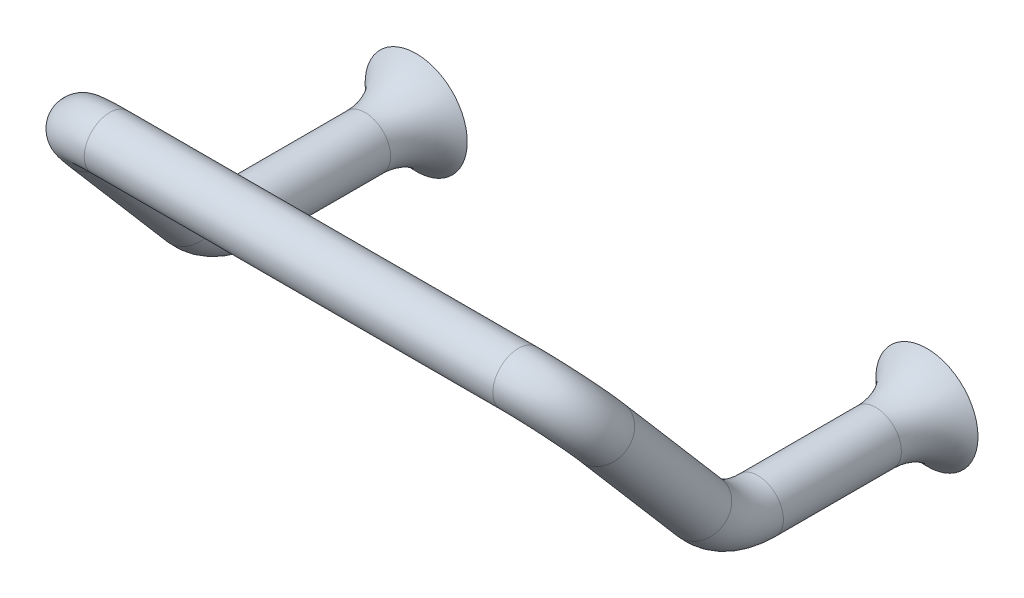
ISO-10303-21;
HEADER;
FILE_DESCRIPTION(('STEP AP214'),'2;1');
FILE_NAME('part.step','',(''),(''),'','','');
FILE_SCHEMA(('AUTOMOTIVE_DESIGN { 1 0 10303 214 1 1 1 1 }'));
ENDSEC;
DATA;
#1=APPLICATION_CONTEXT('core data for automotive mechanical design processes');
#2=APPLICATION_PROTOCOL_DEFINITION('international standard','automotive_design',2000,#1);
#3=PRODUCT_CONTEXT('',#1,'mechanical');
#4=PRODUCT('Part','Part','',(#3));
#5=PRODUCT_RELATED_PRODUCT_CATEGORY('part','',(#4));
#6=PRODUCT_DEFINITION_FORMATION('','',#4);
#7=PRODUCT_DEFINITION_CONTEXT('part definition',#1,'design');
#8=PRODUCT_DEFINITION('design','',#6,#7);
#9=PRODUCT_DEFINITION_SHAPE('','',#8);
#10=(LENGTH_UNIT() NAMED_UNIT(*) SI_UNIT(.MILLI.,.METRE.));
#11=(NAMED_UNIT(*) PLANE_ANGLE_UNIT() SI_UNIT($,.RADIAN.));
#12=(NAMED_UNIT(*) SI_UNIT($,.STERADIAN.) SOLID_ANGLE_UNIT());
#13=UNCERTAINTY_MEASURE_WITH_UNIT(LENGTH_MEASURE(1.E-05),#10,'distance_accuracy_value','');
#14=(GEOMETRIC_REPRESENTATION_CONTEXT(3) GLOBAL_UNCERTAINTY_ASSIGNED_CONTEXT((#13)) GLOBAL_UNIT_ASSIGNED_CONTEXT((#10,
#11,#12)) REPRESENTATION_CONTEXT('',''));
#15=CARTESIAN_POINT('',(0.,0.,0.));
#16=DIRECTION('',(0.,0.,1.));
#17=DIRECTION('',(1.,0.,0.));
#18=AXIS2_PLACEMENT_3D('',#15,#16,#17);
#19=CARTESIAN_POINT('',(100.,0.,33.1009761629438));
#20=DIRECTION('',(0.,0.,-1.));
#21=DIRECTION('',(0.,1.,0.));
#22=AXIS2_PLACEMENT_3D('',#19,#20,#21);
#23=CYLINDRICAL_SURFACE('',#22,5.);
#24=CARTESIAN_POINT('',(100.,0.,33.1009761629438));
#25=DIRECTION('',(0.,0.,-1.));
#26=DIRECTION('',(0.,-1.,0.));
#27=AXIS2_PLACEMENT_3D('',#24,#25,#26);
#28=CIRCLE('',#27,5.);
#29=CARTESIAN_POINT('',(100.,-5.,33.1009761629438));
#30=VERTEX_POINT('',#29);
#31=EDGE_CURVE('E32',#30,#30,#28,.T.);
#32=ORIENTED_EDGE('',*,*,#31,.T.);
#33=EDGE_LOOP('',(#32));
#34=FACE_BOUND('',#33,.T.);
#35=CARTESIAN_POINT('',(100.,0.,10.));
#36=DIRECTION('',(0.,0.,-1.));
#37=DIRECTION('',(1.,0.,0.));
#38=AXIS2_PLACEMENT_3D('',#35,#36,#37);
#39=CIRCLE('',#38,5.);
#40=CARTESIAN_POINT('',(105.,0.,9.99999999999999));
#41=VERTEX_POINT('',#40);
#42=EDGE_CURVE('E62',#41,#41,#39,.T.);
#43=ORIENTED_EDGE('',*,*,#42,.F.);
#44=EDGE_LOOP('',(#43));
#45=FACE_BOUND('',#44,.T.);
#46=ADVANCED_FACE('F12',(#34,#45),#23,.T.);
#47=CARTESIAN_POINT('',(100.,15.,33.1009761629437));
#48=DIRECTION('',(1.,0.,0.));
#49=DIRECTION('',(0.,1.,0.));
#50=AXIS2_PLACEMENT_3D('',#47,#48,#49);
#51=TOROIDAL_SURFACE('',#50,15.,5.);
#52=CARTESIAN_POINT('',(100.,5.23812939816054,44.4898251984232));
#53=DIRECTION('',(0.,-0.759256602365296,-0.650791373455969));
#54=DIRECTION('',(0.,-0.65079137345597,0.759256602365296));
#55=AXIS2_PLACEMENT_3D('',#52,#53,#54);
#56=CIRCLE('',#55,5.);
#57=CARTESIAN_POINT('',(100.,1.98417253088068,48.2861082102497));
#58=VERTEX_POINT('',#57);
#59=EDGE_CURVE('E35',#58,#58,#56,.T.);
#60=CARTESIAN_POINT('',(100.,15.,33.1009761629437));
#61=DIRECTION('',(1.,0.,0.));
#62=DIRECTION('',(0.,1.,0.));
#63=AXIS2_PLACEMENT_3D('',#60,#61,#62);
#64=CIRCLE('',#63,20.);
#65=EDGE_CURVE('',#58,#30,#64,.T.);
#66=ORIENTED_EDGE('',*,*,#59,.T.);
#67=ORIENTED_EDGE('',*,*,#31,.F.);
#68=ORIENTED_EDGE('',*,*,#65,.T.);
#69=ORIENTED_EDGE('',*,*,#65,.F.);
#70=EDGE_LOOP('',(#66,#68,#67,#69));
#71=FACE_BOUND('',#70,.T.);
#72=ADVANCED_FACE('F94',(#71),#51,.T.);
#73=CARTESIAN_POINT('',(100.,27.4074339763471,63.4920862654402));
#74=DIRECTION('',(0.,-0.759256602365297,-0.650791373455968));
#75=DIRECTION('',(0.,0.650791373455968,-0.759256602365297));
#76=AXIS2_PLACEMENT_3D('',#73,#74,#75);
#77=CYLINDRICAL_SURFACE('',#76,5.);
#78=CARTESIAN_POINT('',(100.,27.4074339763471,63.4920862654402));
#79=DIRECTION('',(0.,-0.759256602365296,-0.650791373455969));
#80=DIRECTION('',(0.,-0.65079137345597,0.759256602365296));
#81=AXIS2_PLACEMENT_3D('',#78,#79,#80);
#82=CIRCLE('',#81,5.);
#83=CARTESIAN_POINT('',(105.,27.4074339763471,63.4920862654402));
#84=VERTEX_POINT('',#83);
#85=EDGE_CURVE('E38',#84,#84,#82,.T.);
#86=ORIENTED_EDGE('',*,*,#85,.T.);
#87=EDGE_LOOP('',(#86));
#88=FACE_BOUND('',#87,.T.);
#89=ORIENTED_EDGE('',*,*,#59,.F.);
#90=EDGE_LOOP('',(#89));
#91=FACE_BOUND('',#90,.T.);
#92=ADVANCED_FACE('F101',(#88,#91),#77,.T.);
#93=CARTESIAN_POINT('',(90.,27.4074339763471,63.4920862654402));
#94=DIRECTION('',(0.,0.650791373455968,-0.759256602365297));
#95=DIRECTION('',(0.,0.759256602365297,0.650791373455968));
#96=AXIS2_PLACEMENT_3D('',#93,#94,#95);
#97=TOROIDAL_SURFACE('',#96,10.,5.);
#98=CARTESIAN_POINT('',(90.,35.,70.));
#99=DIRECTION('',(1.,0.,0.));
#100=DIRECTION('',(0.,-0.650791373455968,0.759256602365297));
#101=AXIS2_PLACEMENT_3D('',#98,#99,#100);
#102=CIRCLE('',#101,5.);
#103=CARTESIAN_POINT('',(90.,38.7962830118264,73.2539568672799));
#104=VERTEX_POINT('',#103);
#105=EDGE_CURVE('E41',#104,#104,#102,.T.);
#106=CARTESIAN_POINT('',(90.,27.4074339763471,63.4920862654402));
#107=DIRECTION('',(0.,0.650791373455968,-0.759256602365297));
#108=DIRECTION('',(0.,0.759256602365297,0.650791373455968));
#109=AXIS2_PLACEMENT_3D('',#106,#107,#108);
#110=CIRCLE('',#109,15.);
#111=EDGE_CURVE('',#104,#84,#110,.T.);
#112=ORIENTED_EDGE('',*,*,#105,.T.);
#113=ORIENTED_EDGE('',*,*,#85,.F.);
#114=ORIENTED_EDGE('',*,*,#111,.T.);
#115=ORIENTED_EDGE('',*,*,#111,.F.);
#116=EDGE_LOOP('',(#112,#114,#113,#115));
#117=FACE_BOUND('',#116,.T.);
#118=ADVANCED_FACE('F158',(#117),#97,.T.);
#119=CARTESIAN_POINT('',(10.,35.,70.));
#120=DIRECTION('',(1.,0.,0.));
#121=DIRECTION('',(0.,0.,1.));
#122=AXIS2_PLACEMENT_3D('',#119,#120,#121);
#123=CYLINDRICAL_SURFACE('',#122,5.);
#124=CARTESIAN_POINT('',(10.,35.,70.));
#125=DIRECTION('',(1.,0.,0.));
#126=DIRECTION('',(0.,-0.650791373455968,0.759256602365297));
#127=AXIS2_PLACEMENT_3D('',#124,#125,#126);
#128=CIRCLE('',#127,5.);
#129=CARTESIAN_POINT('',(10.,38.7962830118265,73.2539568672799));
#130=VERTEX_POINT('',#129);
#131=EDGE_CURVE('E44',#130,#130,#128,.T.);
#132=ORIENTED_EDGE('',*,*,#131,.T.);
#133=EDGE_LOOP('',(#132));
#134=FACE_BOUND('',#133,.T.);
#135=ORIENTED_EDGE('',*,*,#105,.F.);
#136=EDGE_LOOP('',(#135));
#137=FACE_BOUND('',#136,.T.);
#138=ADVANCED_FACE('F154',(#134,#137),#123,.T.);
#139=CARTESIAN_POINT('',(10.,27.4074339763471,63.4920862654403));
#140=DIRECTION('',(0.,0.650791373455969,-0.759256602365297));
#141=DIRECTION('',(0.,0.759256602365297,0.650791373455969));
#142=AXIS2_PLACEMENT_3D('',#139,#140,#141);
#143=TOROIDAL_SURFACE('',#142,10.,5.);
#144=CARTESIAN_POINT('',(0.,27.4074339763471,63.4920862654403));
#145=DIRECTION('',(0.,0.759256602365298,0.650791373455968));
#146=DIRECTION('',(0.,-0.650791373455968,0.759256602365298));
#147=AXIS2_PLACEMENT_3D('',#144,#145,#146);
#148=CIRCLE('',#147,5.);
#149=CARTESIAN_POINT('',(-5.,27.4074339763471,63.4920862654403));
#150=VERTEX_POINT('',#149);
#151=EDGE_CURVE('E47',#150,#150,#148,.T.);
#152=CARTESIAN_POINT('',(10.,27.4074339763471,63.4920862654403));
#153=DIRECTION('',(0.,0.650791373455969,-0.759256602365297));
#154=DIRECTION('',(0.,0.759256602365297,0.650791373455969));
#155=AXIS2_PLACEMENT_3D('',#152,#153,#154);
#156=CIRCLE('',#155,15.);
#157=EDGE_CURVE('',#150,#130,#156,.T.);
#158=ORIENTED_EDGE('',*,*,#151,.T.);
#159=ORIENTED_EDGE('',*,*,#131,.F.);
#160=ORIENTED_EDGE('',*,*,#157,.T.);
#161=ORIENTED_EDGE('',*,*,#157,.F.);
#162=EDGE_LOOP('',(#158,#160,#159,#161));
#163=FACE_BOUND('',#162,.T.);
#164=ADVANCED_FACE('F150',(#163),#143,.T.);
#165=CARTESIAN_POINT('',(0.,5.23812939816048,44.4898251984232));
#166=DIRECTION('',(0.,0.759256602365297,0.650791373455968));
#167=DIRECTION('',(0.,-0.650791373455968,0.759256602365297));
#168=AXIS2_PLACEMENT_3D('',#165,#166,#167);
#169=CYLINDRICAL_SURFACE('',#168,5.);
#170=CARTESIAN_POINT('',(0.,5.23812939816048,44.4898251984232));
#171=DIRECTION('',(0.,0.759256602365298,0.650791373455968));
#172=DIRECTION('',(0.,-0.650791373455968,0.759256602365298));
#173=AXIS2_PLACEMENT_3D('',#170,#171,#172);
#174=CIRCLE('',#173,5.);
#175=CARTESIAN_POINT('',(0.,1.98417253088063,48.2861082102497));
#176=VERTEX_POINT('',#175);
#177=EDGE_CURVE('E50',#176,#176,#174,.T.);
#178=ORIENTED_EDGE('',*,*,#177,.T.);
#179=EDGE_LOOP('',(#178));
#180=FACE_BOUND('',#179,.T.);
#181=ORIENTED_EDGE('',*,*,#151,.F.);
#182=EDGE_LOOP('',(#181));
#183=FACE_BOUND('',#182,.T.);
#184=ADVANCED_FACE('F146',(#180,#183),#169,.T.);
#185=CARTESIAN_POINT('',(0.,15.,33.1009761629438));
#186=DIRECTION('',(-1.,0.,0.));
#187=DIRECTION('',(0.,-1.,0.));
#188=AXIS2_PLACEMENT_3D('',#185,#186,#187);
#189=TOROIDAL_SURFACE('',#188,15.,5.);
#190=CARTESIAN_POINT('',(0.,0.,33.1009761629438));
#191=DIRECTION('',(0.,0.,1.));
#192=DIRECTION('',(0.,-1.,0.));
#193=AXIS2_PLACEMENT_3D('',#190,#191,#192);
#194=CIRCLE('',#193,5.);
#195=CARTESIAN_POINT('',(0.,-5.,33.1009761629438));
#196=VERTEX_POINT('',#195);
#197=EDGE_CURVE('E53',#196,#196,#194,.T.);
#198=CARTESIAN_POINT('',(0.,15.,33.1009761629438));
#199=DIRECTION('',(-1.,0.,0.));
#200=DIRECTION('',(0.,-1.,0.));
#201=AXIS2_PLACEMENT_3D('',#198,#199,#200);
#202=CIRCLE('',#201,20.);
#203=EDGE_CURVE('',#196,#176,#202,.T.);
#204=ORIENTED_EDGE('',*,*,#197,.T.);
#205=ORIENTED_EDGE('',*,*,#177,.F.);
#206=ORIENTED_EDGE('',*,*,#203,.T.);
#207=ORIENTED_EDGE('',*,*,#203,.F.);
#208=EDGE_LOOP('',(#204,#206,#205,#207));
#209=FACE_BOUND('',#208,.T.);
#210=ADVANCED_FACE('F142',(#209),#189,.T.);
#211=CARTESIAN_POINT('',(0.,0.,33.1009761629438));
#212=DIRECTION('',(0.,0.,-1.));
#213=DIRECTION('',(0.,1.,0.));
#214=AXIS2_PLACEMENT_3D('',#211,#212,#213);
#215=CYLINDRICAL_SURFACE('',#214,5.);
#216=CARTESIAN_POINT('',(0.,0.,10.));
#217=DIRECTION('',(0.,0.,-1.));
#218=DIRECTION('',(0.,1.,0.));
#219=AXIS2_PLACEMENT_3D('',#216,#217,#218);
#220=CIRCLE('',#219,5.);
#221=CARTESIAN_POINT('',(0.,5.,10.));
#222=VERTEX_POINT('',#221);
#223=EDGE_CURVE('E59',#222,#222,#220,.T.);
#224=ORIENTED_EDGE('',*,*,#223,.F.);
#225=EDGE_LOOP('',(#224));
#226=FACE_BOUND('',#225,.T.);
#227=ORIENTED_EDGE('',*,*,#197,.F.);
#228=EDGE_LOOP('',(#227));
#229=FACE_BOUND('',#228,.T.);
#230=ADVANCED_FACE('F137',(#226,#229),#215,.T.);
#231=CARTESIAN_POINT('',(0.,0.,10.));
#232=DIRECTION('',(0.,0.,-1.));
#233=DIRECTION('',(0.,1.,0.));
#234=AXIS2_PLACEMENT_3D('',#231,#232,#233);
#235=TOROIDAL_SURFACE('',#234,17.5,12.5);
#236=ORIENTED_EDGE('',*,*,#223,.T.);
#237=EDGE_LOOP('',(#236));
#238=FACE_BOUND('',#237,.T.);
#239=CARTESIAN_POINT('',(0.,0.,0.));
#240=DIRECTION('',(0.,0.,-1.));
#241=DIRECTION('',(0.,1.,0.));
#242=AXIS2_PLACEMENT_3D('',#239,#240,#241);
#243=CIRCLE('',#242,10.);
#244=CARTESIAN_POINT('',(0.,9.99999999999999,0.));
#245=VERTEX_POINT('',#244);
#246=EDGE_CURVE('E56',#245,#245,#243,.T.);
#247=ORIENTED_EDGE('',*,*,#246,.F.);
#248=EDGE_LOOP('',(#247));
#249=FACE_BOUND('',#248,.T.);
#250=ADVANCED_FACE('F132',(#238,#249),#235,.F.);
#251=CARTESIAN_POINT('',(0.,0.,0.));
#252=DIRECTION('',(0.,0.,1.));
#253=DIRECTION('',(0.,-1.,0.));
#254=AXIS2_PLACEMENT_3D('',#251,#252,#253);
#255=PLANE('',#254);
#256=CARTESIAN_POINT('',(0.,0.,0.));
#257=DIRECTION('',(0.,0.,1.));
#258=DIRECTION('',(1.,0.,0.));
#259=AXIS2_PLACEMENT_3D('',#256,#257,#258);
#260=CIRCLE('',#259,2.95);
#261=CARTESIAN_POINT('',(2.95,0.,0.));
#262=VERTEX_POINT('',#261);
#263=EDGE_CURVE('E8',#262,#262,#260,.T.);
#264=ORIENTED_EDGE('',*,*,#263,.T.);
#265=EDGE_LOOP('',(#264));
#266=FACE_BOUND('',#265,.T.);
#267=ORIENTED_EDGE('',*,*,#246,.T.);
#268=EDGE_LOOP('',(#267));
#269=FACE_BOUND('',#268,.T.);
#270=ADVANCED_FACE('F125',(#266,#269),#255,.F.);
#271=CARTESIAN_POINT('',(100.,0.,10.));
#272=DIRECTION('',(0.,0.,-1.));
#273=DIRECTION('',(1.,0.,0.));
#274=AXIS2_PLACEMENT_3D('',#271,#272,#273);
#275=TOROIDAL_SURFACE('',#274,17.5,12.5);
#276=ORIENTED_EDGE('',*,*,#42,.T.);
#277=EDGE_LOOP('',(#276));
#278=FACE_BOUND('',#277,.T.);
#279=CARTESIAN_POINT('',(100.,0.,0.));
#280=DIRECTION('',(0.,0.,-1.));
#281=DIRECTION('',(1.,0.,0.));
#282=AXIS2_PLACEMENT_3D('',#279,#280,#281);
#283=CIRCLE('',#282,10.);
#284=CARTESIAN_POINT('',(110.,0.,0.));
#285=VERTEX_POINT('',#284);
#286=EDGE_CURVE('E65',#285,#285,#283,.T.);
#287=ORIENTED_EDGE('',*,*,#286,.F.);
#288=EDGE_LOOP('',(#287));
#289=FACE_BOUND('',#288,.T.);
#290=ADVANCED_FACE('F120',(#278,#289),#275,.F.);
#291=CARTESIAN_POINT('',(100.,0.,0.));
#292=DIRECTION('',(0.,0.,-1.));
#293=DIRECTION('',(0.,-1.,0.));
#294=AXIS2_PLACEMENT_3D('',#291,#292,#293);
#295=PLANE('',#294);
#296=CARTESIAN_POINT('',(100.,0.,0.));
#297=DIRECTION('',(0.,0.,-1.));
#298=DIRECTION('',(-1.,0.,0.));
#299=AXIS2_PLACEMENT_3D('',#296,#297,#298);
#300=CIRCLE('',#299,2.95);
#301=CARTESIAN_POINT('',(97.05,0.,0.));
#302=VERTEX_POINT('',#301);
#303=EDGE_CURVE('E23',#302,#302,#300,.F.);
#304=ORIENTED_EDGE('',*,*,#303,.T.);
#305=EDGE_LOOP('',(#304));
#306=FACE_BOUND('',#305,.T.);
#307=ORIENTED_EDGE('',*,*,#286,.T.);
#308=EDGE_LOOP('',(#307));
#309=FACE_BOUND('',#308,.T.);
#310=ADVANCED_FACE('F117',(#306,#309),#295,.T.);
#311=CARTESIAN_POINT('',(0.,0.,10.));
#312=DIRECTION('',(0.,0.,-1.));
#313=DIRECTION('',(0.,1.,0.));
#314=AXIS2_PLACEMENT_3D('',#311,#312,#313);
#315=CYLINDRICAL_SURFACE('',#314,2.5);
#316=CARTESIAN_POINT('',(0.,0.,0.45));
#317=DIRECTION('',(0.,0.,1.));
#318=DIRECTION('',(1.,0.,0.));
#319=AXIS2_PLACEMENT_3D('',#316,#317,#318);
#320=CIRCLE('',#319,2.5);
#321=CARTESIAN_POINT('',(2.5,0.,0.45));
#322=VERTEX_POINT('',#321);
#323=EDGE_CURVE('E19',#322,#322,#320,.F.);
#324=ORIENTED_EDGE('',*,*,#323,.T.);
#325=EDGE_LOOP('',(#324));
#326=FACE_BOUND('',#325,.T.);
#327=CARTESIAN_POINT('',(0.,0.,10.));
#328=DIRECTION('',(0.,0.,-1.));
#329=DIRECTION('',(0.,1.,0.));
#330=AXIS2_PLACEMENT_3D('',#327,#328,#329);
#331=CIRCLE('',#330,2.5);
#332=CARTESIAN_POINT('',(0.,2.5,10.));
#333=VERTEX_POINT('',#332);
#334=EDGE_CURVE('E68',#333,#333,#331,.T.);
#335=ORIENTED_EDGE('',*,*,#334,.F.);
#336=EDGE_LOOP('',(#335));
#337=FACE_BOUND('',#336,.T.);
#338=ADVANCED_FACE('F90',(#326,#337),#315,.F.);
#339=CARTESIAN_POINT('',(0.,0.,10.));
#340=DIRECTION('',(0.,0.,-1.));
#341=DIRECTION('',(0.,1.,0.));
#342=AXIS2_PLACEMENT_3D('',#339,#340,#341);
#343=PLANE('',#342);
#344=ORIENTED_EDGE('',*,*,#334,.T.);
#345=EDGE_LOOP('',(#344));
#346=FACE_BOUND('',#345,.T.);
#347=ADVANCED_FACE('F79',(#346),#343,.T.);
#348=CARTESIAN_POINT('',(100.,0.,10.));
#349=DIRECTION('',(0.,0.,-1.));
#350=DIRECTION('',(0.,1.,0.));
#351=AXIS2_PLACEMENT_3D('',#348,#349,#350);
#352=CYLINDRICAL_SURFACE('',#351,2.5);
#353=CARTESIAN_POINT('',(100.,0.,0.45));
#354=DIRECTION('',(0.,0.,-1.));
#355=DIRECTION('',(-1.,0.,0.));
#356=AXIS2_PLACEMENT_3D('',#353,#354,#355);
#357=CIRCLE('',#356,2.5);
#358=CARTESIAN_POINT('',(97.5,0.,0.45));
#359=VERTEX_POINT('',#358);
#360=EDGE_CURVE('E27',#359,#359,#357,.T.);
#361=ORIENTED_EDGE('',*,*,#360,.T.);
#362=EDGE_LOOP('',(#361));
#363=FACE_BOUND('',#362,.T.);
#364=CARTESIAN_POINT('',(100.,0.,10.));
#365=DIRECTION('',(0.,0.,-1.));
#366=DIRECTION('',(0.,1.,0.));
#367=AXIS2_PLACEMENT_3D('',#364,#365,#366);
#368=CIRCLE('',#367,2.5);
#369=CARTESIAN_POINT('',(100.,2.50000000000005,10.));
#370=VERTEX_POINT('',#369);
#371=EDGE_CURVE('E71',#370,#370,#368,.T.);
#372=ORIENTED_EDGE('',*,*,#371,.F.);
#373=EDGE_LOOP('',(#372));
#374=FACE_BOUND('',#373,.T.);
#375=ADVANCED_FACE('F77',(#363,#374),#352,.F.);
#376=CARTESIAN_POINT('',(100.,0.,10.));
#377=DIRECTION('',(0.,0.,-1.));
#378=DIRECTION('',(0.,1.,0.));
#379=AXIS2_PLACEMENT_3D('',#376,#377,#378);
#380=PLANE('',#379);
#381=ORIENTED_EDGE('',*,*,#371,.T.);
#382=EDGE_LOOP('',(#381));
#383=FACE_BOUND('',#382,.T.);
#384=ADVANCED_FACE('F75',(#383),#380,.T.);
#385=CARTESIAN_POINT('',(100.,0.,0.45));
#386=DIRECTION('',(0.,0.,-1.));
#387=DIRECTION('',(-1.,0.,0.));
#388=AXIS2_PLACEMENT_3D('',#385,#386,#387);
#389=CONICAL_SURFACE('',#388,2.5,0.785398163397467);
#390=ORIENTED_EDGE('',*,*,#303,.F.);
#391=EDGE_LOOP('',(#390));
#392=FACE_BOUND('',#391,.T.);
#393=ORIENTED_EDGE('',*,*,#360,.F.);
#394=EDGE_LOOP('',(#393));
#395=FACE_BOUND('',#394,.T.);
#396=ADVANCED_FACE('F88',(#392,#395),#389,.F.);
#397=CARTESIAN_POINT('',(0.,0.,0.45));
#398=DIRECTION('',(0.,0.,-1.));
#399=DIRECTION('',(-1.,0.,0.));
#400=AXIS2_PLACEMENT_3D('',#397,#398,#399);
#401=CONICAL_SURFACE('',#400,2.5,0.785398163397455);
#402=ORIENTED_EDGE('',*,*,#263,.F.);
#403=EDGE_LOOP('',(#402));
#404=FACE_BOUND('',#403,.T.);
#405=ORIENTED_EDGE('',*,*,#323,.F.);
#406=EDGE_LOOP('',(#405));
#407=FACE_BOUND('',#406,.T.);
#408=ADVANCED_FACE('F14',(#404,#407),#401,.F.);
#409=CLOSED_SHELL('',(#46,#72,#92,#118,#138,#164,#184,#210,#230,#250,#270,#290,#310,#338,#347,
#375,#384,#396,#408));
#410=MANIFOLD_SOLID_BREP('B1',#409);
#411=ADVANCED_BREP_SHAPE_REPRESENTATION('',(#18,#410),#14);
#412=SHAPE_DEFINITION_REPRESENTATION(#9,#411);
ENDSEC;
END-ISO-10303-21;
